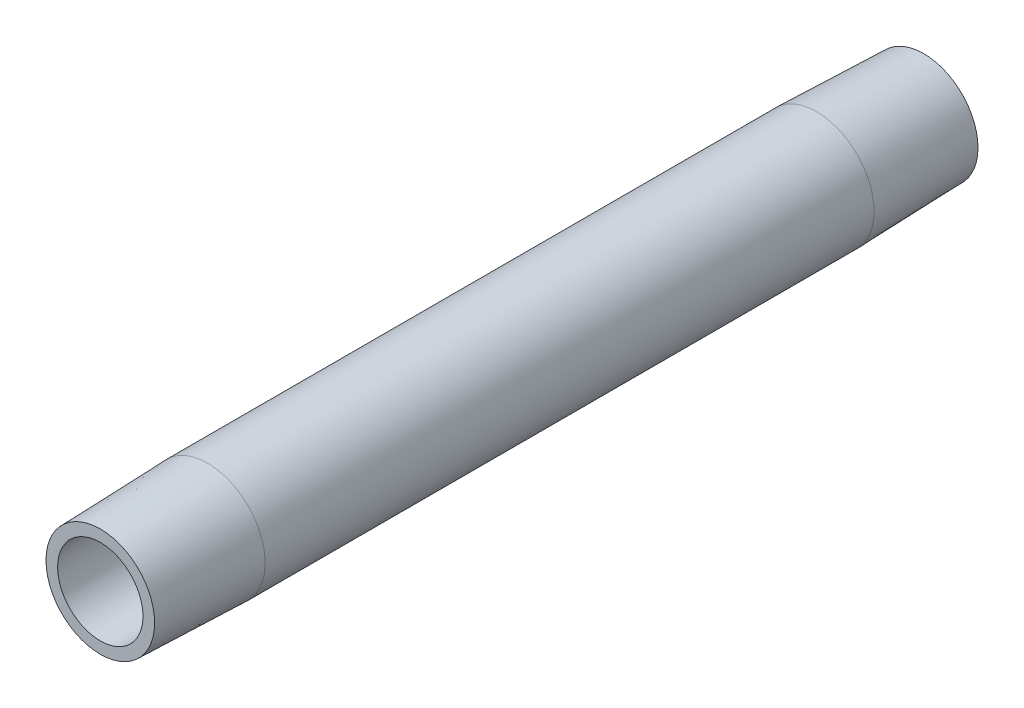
from build123d import *

# Parameters (mm, degrees)
PIPESKETCH_R    = 10.668
PIPESKETCH_R_2  = 7.8994
EXTRUSION_DEPTH = 152.4


with BuildPart() as part:
    # PipeSketch → Extrusion (new body)
    with BuildSketch(Plane.XY):
        with Locations(Location((0, 0, 0), (0, 0, 180))):
            Circle(PIPESKETCH_R)
        with Locations(Location((0, 0, 0), (0, 0, 180))):
            Circle(PIPESKETCH_R_2, mode=Mode.SUBTRACT)
    extrude(amount=EXTRUSION_DEPTH)

    # ThdSketch → Thread (revolve, cut)
    with BuildSketch(Plane(origin=(0, 0, 0), x_dir=(0, 0, -1), z_dir=(1, 0, 0)), mode=Mode.PRIVATE) as thread_sk:
        Polygon((-132.5499, 10.668), (-152.4, 10.049965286), (-152.4, 10.668), align=None)
        Polygon((0, 10.668), (-19.8501, 10.668), (0, 10.049965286), align=None)
    revolve(thread_sk.sketch.rotate(Axis((0, 0, 152.4), (0, 0, -1)), 270), axis=Axis((0, 0, 152.4), (0, 0, -1)), mode=Mode.SUBTRACT)


solid = part.part
